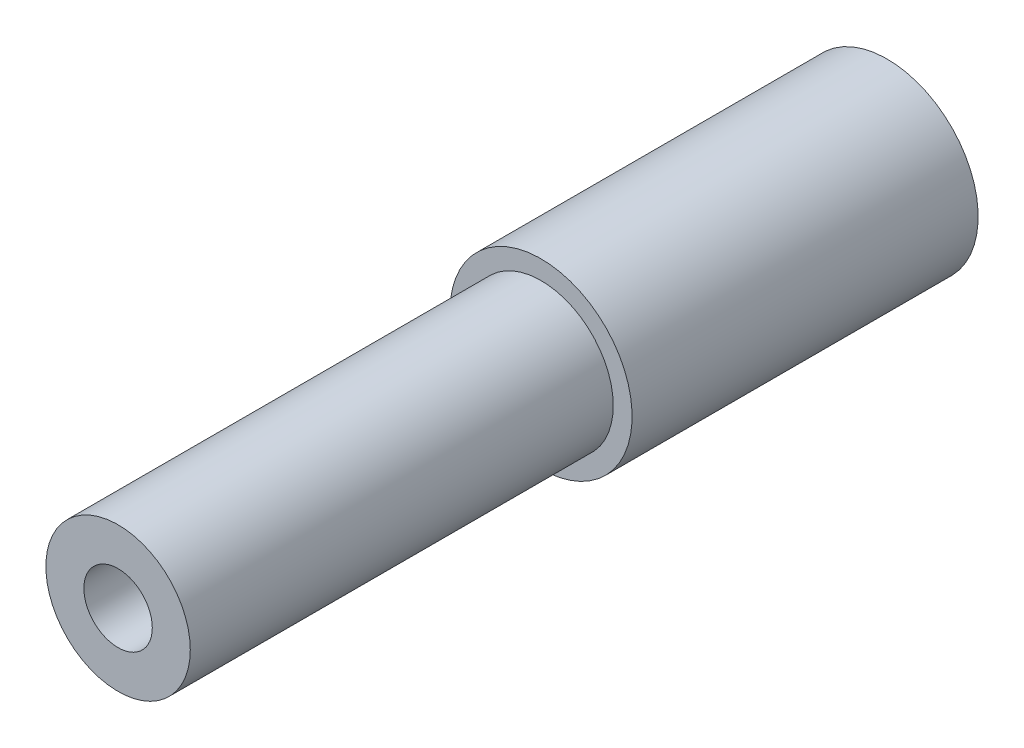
ISO-10303-21;
HEADER;
FILE_DESCRIPTION(('STEP AP214'),'2;1');
FILE_NAME('part.step','',(''),(''),'','','');
FILE_SCHEMA(('AUTOMOTIVE_DESIGN { 1 0 10303 214 1 1 1 1 }'));
ENDSEC;
DATA;
#1=APPLICATION_CONTEXT('core data for automotive mechanical design processes');
#2=APPLICATION_PROTOCOL_DEFINITION('international standard','automotive_design',2000,#1);
#3=PRODUCT_CONTEXT('',#1,'mechanical');
#4=PRODUCT('Part','Part','',(#3));
#5=PRODUCT_RELATED_PRODUCT_CATEGORY('part','',(#4));
#6=PRODUCT_DEFINITION_FORMATION('','',#4);
#7=PRODUCT_DEFINITION_CONTEXT('part definition',#1,'design');
#8=PRODUCT_DEFINITION('design','',#6,#7);
#9=PRODUCT_DEFINITION_SHAPE('','',#8);
#10=(LENGTH_UNIT() NAMED_UNIT(*) SI_UNIT(.MILLI.,.METRE.));
#11=(NAMED_UNIT(*) PLANE_ANGLE_UNIT() SI_UNIT($,.RADIAN.));
#12=(NAMED_UNIT(*) SI_UNIT($,.STERADIAN.) SOLID_ANGLE_UNIT());
#13=UNCERTAINTY_MEASURE_WITH_UNIT(LENGTH_MEASURE(1.E-05),#10,'distance_accuracy_value','');
#14=(GEOMETRIC_REPRESENTATION_CONTEXT(3) GLOBAL_UNCERTAINTY_ASSIGNED_CONTEXT((#13)) GLOBAL_UNIT_ASSIGNED_CONTEXT((#10,
#11,#12)) REPRESENTATION_CONTEXT('',''));
#15=CARTESIAN_POINT('',(0.,0.,0.));
#16=DIRECTION('',(0.,0.,1.));
#17=DIRECTION('',(1.,0.,0.));
#18=AXIS2_PLACEMENT_3D('',#15,#16,#17);
#19=CARTESIAN_POINT('',(0.,0.,-25.4));
#20=DIRECTION('',(0.,0.,0.999999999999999));
#21=DIRECTION('',(1.,0.,0.));
#22=AXIS2_PLACEMENT_3D('',#19,#20,#21);
#23=CYLINDRICAL_SURFACE('',#22,2.38506);
#24=CARTESIAN_POINT('',(0.,0.,0.));
#25=DIRECTION('',(0.,0.,0.999999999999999));
#26=DIRECTION('',(1.,0.,0.));
#27=AXIS2_PLACEMENT_3D('',#24,#25,#26);
#28=CIRCLE('',#27,2.38506);
#29=CARTESIAN_POINT('',(2.38505999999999,0.,0.));
#30=VERTEX_POINT('',#29);
#31=EDGE_CURVE('E11',#30,#30,#28,.T.);
#32=CARTESIAN_POINT('',(0.,0.,-13.97));
#33=DIRECTION('',(0.,0.,-0.999999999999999));
#34=DIRECTION('',(-1.,0.,0.));
#35=AXIS2_PLACEMENT_3D('',#32,#33,#34);
#36=CIRCLE('',#35,2.38506);
#37=CARTESIAN_POINT('',(2.38505999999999,0.,-13.97));
#38=VERTEX_POINT('',#37);
#39=EDGE_CURVE('E46',#38,#38,#36,.F.);
#40=CARTESIAN_POINT('',(2.38505999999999,0.,0.));
#41=CARTESIAN_POINT('',(2.38505999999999,0.,-0.145520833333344));
#42=CARTESIAN_POINT('',(2.38505999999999,0.,-0.291041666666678));
#43=CARTESIAN_POINT('',(2.38505999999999,0.,-0.582083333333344));
#44=CARTESIAN_POINT('',(2.38505999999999,0.,-0.727604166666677));
#45=CARTESIAN_POINT('',(2.38505999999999,0.,-1.01864583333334));
#46=CARTESIAN_POINT('',(2.38505999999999,0.,-1.16416666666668));
#47=CARTESIAN_POINT('',(2.38505999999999,0.,-1.45520833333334));
#48=CARTESIAN_POINT('',(2.38505999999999,0.,-1.60072916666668));
#49=CARTESIAN_POINT('',(2.38505999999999,0.,-1.89177083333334));
#50=CARTESIAN_POINT('',(2.38505999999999,0.,-2.03729166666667));
#51=CARTESIAN_POINT('',(2.38505999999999,0.,-2.32833333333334));
#52=CARTESIAN_POINT('',(2.38505999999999,0.,-2.47385416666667));
#53=CARTESIAN_POINT('',(2.38505999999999,0.,-2.76489583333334));
#54=CARTESIAN_POINT('',(2.38505999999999,0.,-2.91041666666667));
#55=CARTESIAN_POINT('',(2.38505999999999,0.,-3.20145833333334));
#56=CARTESIAN_POINT('',(2.38505999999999,0.,-3.34697916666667));
#57=CARTESIAN_POINT('',(2.38505999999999,0.,-3.63802083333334));
#58=CARTESIAN_POINT('',(2.38505999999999,0.,-3.78354166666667));
#59=CARTESIAN_POINT('',(2.38505999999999,0.,-4.07458333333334));
#60=CARTESIAN_POINT('',(2.38505999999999,0.,-4.22010416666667));
#61=CARTESIAN_POINT('',(2.38505999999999,0.,-4.51114583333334));
#62=CARTESIAN_POINT('',(2.38505999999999,0.,-4.65666666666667));
#63=CARTESIAN_POINT('',(2.38505999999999,0.,-4.94770833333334));
#64=CARTESIAN_POINT('',(2.38505999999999,0.,-5.09322916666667));
#65=CARTESIAN_POINT('',(2.38505999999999,0.,-5.38427083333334));
#66=CARTESIAN_POINT('',(2.38505999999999,0.,-5.52979166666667));
#67=CARTESIAN_POINT('',(2.38505999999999,0.,-5.82083333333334));
#68=CARTESIAN_POINT('',(2.38505999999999,0.,-5.96635416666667));
#69=CARTESIAN_POINT('',(2.38505999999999,0.,-6.25739583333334));
#70=CARTESIAN_POINT('',(2.38505999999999,0.,-6.40291666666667));
#71=CARTESIAN_POINT('',(2.38505999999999,0.,-6.69395833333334));
#72=CARTESIAN_POINT('',(2.38505999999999,0.,-6.83947916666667));
#73=CARTESIAN_POINT('',(2.38505999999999,0.,-7.13052083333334));
#74=CARTESIAN_POINT('',(2.38505999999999,0.,-7.27604166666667));
#75=CARTESIAN_POINT('',(2.38505999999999,0.,-7.56708333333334));
#76=CARTESIAN_POINT('',(2.38505999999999,0.,-7.71260416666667));
#77=CARTESIAN_POINT('',(2.38505999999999,0.,-8.00364583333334));
#78=CARTESIAN_POINT('',(2.38505999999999,0.,-8.14916666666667));
#79=CARTESIAN_POINT('',(2.38505999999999,0.,-8.44020833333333));
#80=CARTESIAN_POINT('',(2.38505999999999,0.,-8.58572916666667));
#81=CARTESIAN_POINT('',(2.38505999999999,0.,-8.87677083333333));
#82=CARTESIAN_POINT('',(2.38505999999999,0.,-9.02229166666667));
#83=CARTESIAN_POINT('',(2.38505999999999,0.,-9.31333333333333));
#84=CARTESIAN_POINT('',(2.38505999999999,0.,-9.45885416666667));
#85=CARTESIAN_POINT('',(2.38505999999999,0.,-9.74989583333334));
#86=CARTESIAN_POINT('',(2.38505999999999,0.,-9.89541666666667));
#87=CARTESIAN_POINT('',(2.38505999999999,0.,-10.1864583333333));
#88=CARTESIAN_POINT('',(2.38505999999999,0.,-10.3319791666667));
#89=CARTESIAN_POINT('',(2.38505999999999,0.,-10.6230208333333));
#90=CARTESIAN_POINT('',(2.38505999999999,0.,-10.7685416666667));
#91=CARTESIAN_POINT('',(2.38505999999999,0.,-11.0595833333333));
#92=CARTESIAN_POINT('',(2.38505999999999,0.,-11.2051041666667));
#93=CARTESIAN_POINT('',(2.38505999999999,0.,-11.4961458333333));
#94=CARTESIAN_POINT('',(2.38505999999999,0.,-11.6416666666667));
#95=CARTESIAN_POINT('',(2.38505999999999,0.,-11.9327083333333));
#96=CARTESIAN_POINT('',(2.38505999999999,0.,-12.0782291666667));
#97=CARTESIAN_POINT('',(2.38505999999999,0.,-12.3692708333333));
#98=CARTESIAN_POINT('',(2.38505999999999,0.,-12.5147916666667));
#99=CARTESIAN_POINT('',(2.38505999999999,0.,-12.8058333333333));
#100=CARTESIAN_POINT('',(2.38505999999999,0.,-12.9513541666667));
#101=CARTESIAN_POINT('',(2.38505999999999,0.,-13.2423958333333));
#102=CARTESIAN_POINT('',(2.38505999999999,0.,-13.3879166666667));
#103=CARTESIAN_POINT('',(2.38505999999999,0.,-13.6789583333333));
#104=CARTESIAN_POINT('',(2.38505999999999,0.,-13.8244791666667));
#105=CARTESIAN_POINT('',(2.38505999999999,0.,-13.97));
#106=B_SPLINE_CURVE_WITH_KNOTS('',3,(#40,#41,#42,#43,#44,#45,#46,#47,#48,#49,#50,#51,#52,#53,
#54,#55,#56,#57,#58,#59,#60,#61,#62,#63,#64,#65,#66,#67,#68,#69,#70,#71,#72,#73,#74,#75,#76,#77,
#78,#79,#80,#81,#82,#83,#84,#85,#86,#87,#88,#89,#90,#91,#92,#93,#94,#95,#96,#97,#98,#99,#100,
#101,#102,#103,#104,#105),.UNSPECIFIED.,.F.,.F.,(4,2,2,2,2,2,2,2,2,2,2,2,2,2,2,2,2,2,2,2,2,2,2,
2,2,2,2,2,2,2,2,2,4),(0.,0.436562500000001,0.873124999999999,1.3096875,1.74625,2.1828125,
2.619375,3.05593749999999,3.4925,3.92906249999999,4.36562499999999,4.8021875,5.23875,
5.67531249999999,6.111875,6.54843749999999,6.98499999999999,7.42156249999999,7.85812499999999,
8.29468749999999,8.73124999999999,9.16781249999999,9.60437499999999,10.0409375,10.4775,
10.9140625,11.350625,11.7871875,12.22375,12.6603125,13.096875,13.5334375,13.97),.UNSPECIFIED.);
#107=EDGE_CURVE('BSEAM43',#30,#38,#106,.T.);
#108=ORIENTED_EDGE('',*,*,#31,.F.);
#109=ORIENTED_EDGE('',*,*,#39,.T.);
#110=ORIENTED_EDGE('',*,*,#107,.T.);
#111=ORIENTED_EDGE('',*,*,#107,.F.);
#112=EDGE_LOOP('',(#108,#110,#109,#111));
#113=FACE_BOUND('',#112,.T.);
#114=ADVANCED_FACE('F43',(#113),#23,.T.);
#115=CARTESIAN_POINT('',(0.,0.,0.));
#116=DIRECTION('',(0.,0.,0.999999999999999));
#117=DIRECTION('',(1.,0.,0.));
#118=AXIS2_PLACEMENT_3D('',#115,#116,#117);
#119=PLANE('',#118);
#120=CARTESIAN_POINT('',(0.,0.,0.));
#121=DIRECTION('',(0.,0.,0.999999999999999));
#122=DIRECTION('',(1.,0.,0.));
#123=AXIS2_PLACEMENT_3D('',#120,#121,#122);
#124=CIRCLE('',#123,1.13029999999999);
#125=CARTESIAN_POINT('',(1.13029999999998,0.,0.));
#126=VERTEX_POINT('',#125);
#127=EDGE_CURVE('E66',#126,#126,#124,.T.);
#128=ORIENTED_EDGE('',*,*,#127,.F.);
#129=EDGE_LOOP('',(#128));
#130=FACE_BOUND('',#129,.T.);
#131=ORIENTED_EDGE('',*,*,#31,.T.);
#132=EDGE_LOOP('',(#131));
#133=FACE_BOUND('',#132,.T.);
#134=ADVANCED_FACE('F96',(#130,#133),#119,.T.);
#135=CARTESIAN_POINT('',(0.,0.,-13.97));
#136=DIRECTION('',(0.,0.,-0.999999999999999));
#137=DIRECTION('',(-1.,0.,0.));
#138=AXIS2_PLACEMENT_3D('',#135,#136,#137);
#139=CYLINDRICAL_SURFACE('',#138,3.00736);
#140=CARTESIAN_POINT('',(0.,0.,-13.97));
#141=DIRECTION('',(0.,0.,-0.999999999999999));
#142=DIRECTION('',(-1.,0.,0.));
#143=AXIS2_PLACEMENT_3D('',#140,#141,#142);
#144=CIRCLE('',#143,3.00736);
#145=CARTESIAN_POINT('',(-3.00736000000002,0.,-13.97));
#146=VERTEX_POINT('',#145);
#147=EDGE_CURVE('E71',#146,#146,#144,.T.);
#148=CARTESIAN_POINT('',(0.,0.,-25.4));
#149=DIRECTION('',(0.,0.,-0.999999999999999));
#150=DIRECTION('',(-1.,0.,0.));
#151=AXIS2_PLACEMENT_3D('',#148,#149,#150);
#152=CIRCLE('',#151,3.00736);
#153=CARTESIAN_POINT('',(-3.00736000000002,0.,-25.4));
#154=VERTEX_POINT('',#153);
#155=EDGE_CURVE('E65',#154,#154,#152,.T.);
#156=CARTESIAN_POINT('',(-3.00736000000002,0.,-13.97));
#157=CARTESIAN_POINT('',(-3.00736000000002,0.,-14.0890625));
#158=CARTESIAN_POINT('',(-3.00736000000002,0.,-14.208125));
#159=CARTESIAN_POINT('',(-3.00736000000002,0.,-14.44625));
#160=CARTESIAN_POINT('',(-3.00736000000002,0.,-14.5653125));
#161=CARTESIAN_POINT('',(-3.00736000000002,0.,-14.8034375));
#162=CARTESIAN_POINT('',(-3.00736000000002,0.,-14.9225));
#163=CARTESIAN_POINT('',(-3.00736000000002,0.,-15.160625));
#164=CARTESIAN_POINT('',(-3.00736000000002,0.,-15.2796875));
#165=CARTESIAN_POINT('',(-3.00736000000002,0.,-15.5178125));
#166=CARTESIAN_POINT('',(-3.00736000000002,0.,-15.636875));
#167=CARTESIAN_POINT('',(-3.00736000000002,0.,-15.875));
#168=CARTESIAN_POINT('',(-3.00736000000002,0.,-15.9940625));
#169=CARTESIAN_POINT('',(-3.00736000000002,0.,-16.2321875));
#170=CARTESIAN_POINT('',(-3.00736000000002,0.,-16.35125));
#171=CARTESIAN_POINT('',(-3.00736000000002,0.,-16.589375));
#172=CARTESIAN_POINT('',(-3.00736000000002,0.,-16.7084375));
#173=CARTESIAN_POINT('',(-3.00736000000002,0.,-16.9465625));
#174=CARTESIAN_POINT('',(-3.00736000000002,0.,-17.065625));
#175=CARTESIAN_POINT('',(-3.00736000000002,0.,-17.30375));
#176=CARTESIAN_POINT('',(-3.00736000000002,0.,-17.4228125));
#177=CARTESIAN_POINT('',(-3.00736000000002,0.,-17.6609375));
#178=CARTESIAN_POINT('',(-3.00736000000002,0.,-17.78));
#179=CARTESIAN_POINT('',(-3.00736000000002,0.,-18.018125));
#180=CARTESIAN_POINT('',(-3.00736000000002,0.,-18.1371875));
#181=CARTESIAN_POINT('',(-3.00736000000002,0.,-18.3753125));
#182=CARTESIAN_POINT('',(-3.00736000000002,0.,-18.494375));
#183=CARTESIAN_POINT('',(-3.00736000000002,0.,-18.7325));
#184=CARTESIAN_POINT('',(-3.00736000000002,0.,-18.8515625));
#185=CARTESIAN_POINT('',(-3.00736000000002,0.,-19.0896875));
#186=CARTESIAN_POINT('',(-3.00736000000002,0.,-19.20875));
#187=CARTESIAN_POINT('',(-3.00736000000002,0.,-19.446875));
#188=CARTESIAN_POINT('',(-3.00736000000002,0.,-19.5659375));
#189=CARTESIAN_POINT('',(-3.00736000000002,0.,-19.8040625));
#190=CARTESIAN_POINT('',(-3.00736000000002,0.,-19.923125));
#191=CARTESIAN_POINT('',(-3.00736000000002,0.,-20.16125));
#192=CARTESIAN_POINT('',(-3.00736000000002,0.,-20.2803125));
#193=CARTESIAN_POINT('',(-3.00736000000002,0.,-20.5184375));
#194=CARTESIAN_POINT('',(-3.00736000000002,0.,-20.6375));
#195=CARTESIAN_POINT('',(-3.00736000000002,0.,-20.875625));
#196=CARTESIAN_POINT('',(-3.00736000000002,0.,-20.9946875));
#197=CARTESIAN_POINT('',(-3.00736000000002,0.,-21.2328125));
#198=CARTESIAN_POINT('',(-3.00736000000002,0.,-21.351875));
#199=CARTESIAN_POINT('',(-3.00736000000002,0.,-21.59));
#200=CARTESIAN_POINT('',(-3.00736000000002,0.,-21.7090625));
#201=CARTESIAN_POINT('',(-3.00736000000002,0.,-21.9471875));
#202=CARTESIAN_POINT('',(-3.00736000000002,0.,-22.06625));
#203=CARTESIAN_POINT('',(-3.00736000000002,0.,-22.304375));
#204=CARTESIAN_POINT('',(-3.00736000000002,0.,-22.4234375));
#205=CARTESIAN_POINT('',(-3.00736000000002,0.,-22.6615625));
#206=CARTESIAN_POINT('',(-3.00736000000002,0.,-22.780625));
#207=CARTESIAN_POINT('',(-3.00736000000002,0.,-23.01875));
#208=CARTESIAN_POINT('',(-3.00736000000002,0.,-23.1378125));
#209=CARTESIAN_POINT('',(-3.00736000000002,0.,-23.3759375));
#210=CARTESIAN_POINT('',(-3.00736000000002,0.,-23.495));
#211=CARTESIAN_POINT('',(-3.00736000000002,0.,-23.733125));
#212=CARTESIAN_POINT('',(-3.00736000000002,0.,-23.8521875));
#213=CARTESIAN_POINT('',(-3.00736000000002,0.,-24.0903125));
#214=CARTESIAN_POINT('',(-3.00736000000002,0.,-24.209375));
#215=CARTESIAN_POINT('',(-3.00736000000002,0.,-24.4475));
#216=CARTESIAN_POINT('',(-3.00736000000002,0.,-24.5665625));
#217=CARTESIAN_POINT('',(-3.00736000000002,0.,-24.8046875));
#218=CARTESIAN_POINT('',(-3.00736000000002,0.,-24.92375));
#219=CARTESIAN_POINT('',(-3.00736000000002,0.,-25.161875));
#220=CARTESIAN_POINT('',(-3.00736000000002,0.,-25.2809375));
#221=CARTESIAN_POINT('',(-3.00736000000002,0.,-25.4));
#222=B_SPLINE_CURVE_WITH_KNOTS('',3,(#156,#157,#158,#159,#160,#161,#162,#163,#164,#165,#166,
#167,#168,#169,#170,#171,#172,#173,#174,#175,#176,#177,#178,#179,#180,#181,#182,#183,#184,#185,
#186,#187,#188,#189,#190,#191,#192,#193,#194,#195,#196,#197,#198,#199,#200,#201,#202,#203,#204,
#205,#206,#207,#208,#209,#210,#211,#212,#213,#214,#215,#216,#217,#218,#219,#220,#221),
.UNSPECIFIED.,.F.,.F.,(4,2,2,2,2,2,2,2,2,2,2,2,2,2,2,2,2,2,2,2,2,2,2,2,2,2,2,2,2,2,2,2,4),(0.,
0.357187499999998,0.714374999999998,1.0715625,1.42875,1.7859375,2.14312499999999,
2.50031249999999,2.85749999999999,3.21468749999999,3.57187499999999,3.92906249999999,
4.28624999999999,4.64343749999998,5.00062499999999,5.35781249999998,5.71499999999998,
6.07218749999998,6.42937499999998,6.78656249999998,7.14374999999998,7.50093749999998,
7.85812499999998,8.21531249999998,8.57249999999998,8.92968749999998,9.28687499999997,
9.64406249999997,10.00125,10.3584375,10.715625,11.0728125,11.43),.UNSPECIFIED.);
#223=EDGE_CURVE('BSEAM88',#146,#154,#222,.T.);
#224=ORIENTED_EDGE('',*,*,#147,.T.);
#225=ORIENTED_EDGE('',*,*,#155,.F.);
#226=ORIENTED_EDGE('',*,*,#223,.T.);
#227=ORIENTED_EDGE('',*,*,#223,.F.);
#228=EDGE_LOOP('',(#224,#226,#225,#227));
#229=FACE_BOUND('',#228,.T.);
#230=ADVANCED_FACE('F88',(#229),#139,.T.);
#231=CARTESIAN_POINT('',(0.,0.,-13.97));
#232=DIRECTION('',(0.,0.,-0.999999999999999));
#233=DIRECTION('',(-1.,0.,0.));
#234=AXIS2_PLACEMENT_3D('',#231,#232,#233);
#235=PLANE('',#234);
#236=ORIENTED_EDGE('',*,*,#39,.F.);
#237=EDGE_LOOP('',(#236));
#238=FACE_BOUND('',#237,.T.);
#239=ORIENTED_EDGE('',*,*,#147,.F.);
#240=EDGE_LOOP('',(#239));
#241=FACE_BOUND('',#240,.T.);
#242=ADVANCED_FACE('F85',(#238,#241),#235,.F.);
#243=CARTESIAN_POINT('',(0.,0.,-25.4));
#244=DIRECTION('',(0.,0.,0.999999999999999));
#245=DIRECTION('',(1.,0.,0.));
#246=AXIS2_PLACEMENT_3D('',#243,#244,#245);
#247=PLANE('',#246);
#248=ORIENTED_EDGE('',*,*,#155,.T.);
#249=EDGE_LOOP('',(#248));
#250=FACE_BOUND('',#249,.T.);
#251=ADVANCED_FACE('F58',(#250),#247,.F.);
#252=CARTESIAN_POINT('',(0.,0.,-8.8646));
#253=DIRECTION('',(0.,0.,0.999999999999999));
#254=DIRECTION('',(1.,0.,0.));
#255=AXIS2_PLACEMENT_3D('',#252,#253,#254);
#256=CONICAL_SURFACE('',#255,1.13029999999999,1.02974425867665);
#257=CARTESIAN_POINT('',(0.,0.,-9.54375275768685));
#258=VERTEX_POINT('',#257);
#259=VERTEX_LOOP('',#258);
#260=FACE_BOUND('',#259,.T.);
#261=CARTESIAN_POINT('',(0.,0.,-8.8646));
#262=DIRECTION('',(0.,0.,0.999999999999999));
#263=DIRECTION('',(1.,0.,0.));
#264=AXIS2_PLACEMENT_3D('',#261,#262,#263);
#265=CIRCLE('',#264,1.13029999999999);
#266=CARTESIAN_POINT('',(1.13029999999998,0.,-8.8646));
#267=VERTEX_POINT('',#266);
#268=EDGE_CURVE('E62',#267,#267,#265,.T.);
#269=ORIENTED_EDGE('',*,*,#268,.T.);
#270=EDGE_LOOP('',(#269));
#271=FACE_BOUND('',#270,.T.);
#272=ADVANCED_FACE('F54',(#260,#271),#256,.F.);
#273=CARTESIAN_POINT('',(0.,0.,0.));
#274=DIRECTION('',(0.,0.,0.999999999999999));
#275=DIRECTION('',(1.,0.,0.));
#276=AXIS2_PLACEMENT_3D('',#273,#274,#275);
#277=CYLINDRICAL_SURFACE('',#276,1.13029999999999);
#278=CARTESIAN_POINT('',(1.13029999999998,0.,-8.8646));
#279=CARTESIAN_POINT('',(1.13029999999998,0.,-8.77226041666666));
#280=CARTESIAN_POINT('',(1.13029999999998,0.,-8.67992083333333));
#281=CARTESIAN_POINT('',(1.13029999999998,0.,-8.49524166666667));
#282=CARTESIAN_POINT('',(1.13029999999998,0.,-8.40290208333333));
#283=CARTESIAN_POINT('',(1.13029999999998,0.,-8.21822291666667));
#284=CARTESIAN_POINT('',(1.13029999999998,0.,-8.12588333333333));
#285=CARTESIAN_POINT('',(1.13029999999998,0.,-7.94120416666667));
#286=CARTESIAN_POINT('',(1.13029999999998,0.,-7.84886458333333));
#287=CARTESIAN_POINT('',(1.13029999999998,0.,-7.66418541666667));
#288=CARTESIAN_POINT('',(1.13029999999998,0.,-7.57184583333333));
#289=CARTESIAN_POINT('',(1.13029999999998,0.,-7.38716666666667));
#290=CARTESIAN_POINT('',(1.13029999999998,0.,-7.29482708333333));
#291=CARTESIAN_POINT('',(1.13029999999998,0.,-7.11014791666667));
#292=CARTESIAN_POINT('',(1.13029999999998,0.,-7.01780833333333));
#293=CARTESIAN_POINT('',(1.13029999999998,0.,-6.83312916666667));
#294=CARTESIAN_POINT('',(1.13029999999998,0.,-6.74078958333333));
#295=CARTESIAN_POINT('',(1.13029999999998,0.,-6.55611041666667));
#296=CARTESIAN_POINT('',(1.13029999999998,0.,-6.46377083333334));
#297=CARTESIAN_POINT('',(1.13029999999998,0.,-6.27909166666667));
#298=CARTESIAN_POINT('',(1.13029999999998,0.,-6.18675208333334));
#299=CARTESIAN_POINT('',(1.13029999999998,0.,-6.00207291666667));
#300=CARTESIAN_POINT('',(1.13029999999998,0.,-5.90973333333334));
#301=CARTESIAN_POINT('',(1.13029999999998,0.,-5.72505416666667));
#302=CARTESIAN_POINT('',(1.13029999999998,0.,-5.63271458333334));
#303=CARTESIAN_POINT('',(1.13029999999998,0.,-5.44803541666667));
#304=CARTESIAN_POINT('',(1.13029999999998,0.,-5.35569583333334));
#305=CARTESIAN_POINT('',(1.13029999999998,0.,-5.17101666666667));
#306=CARTESIAN_POINT('',(1.13029999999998,0.,-5.07867708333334));
#307=CARTESIAN_POINT('',(1.13029999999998,0.,-4.89399791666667));
#308=CARTESIAN_POINT('',(1.13029999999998,0.,-4.80165833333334));
#309=CARTESIAN_POINT('',(1.13029999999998,0.,-4.61697916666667));
#310=CARTESIAN_POINT('',(1.13029999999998,0.,-4.52463958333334));
#311=CARTESIAN_POINT('',(1.13029999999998,0.,-4.33996041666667));
#312=CARTESIAN_POINT('',(1.13029999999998,0.,-4.24762083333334));
#313=CARTESIAN_POINT('',(1.13029999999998,0.,-4.06294166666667));
#314=CARTESIAN_POINT('',(1.13029999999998,0.,-3.97060208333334));
#315=CARTESIAN_POINT('',(1.13029999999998,0.,-3.78592291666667));
#316=CARTESIAN_POINT('',(1.13029999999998,0.,-3.69358333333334));
#317=CARTESIAN_POINT('',(1.13029999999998,0.,-3.50890416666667));
#318=CARTESIAN_POINT('',(1.13029999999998,0.,-3.41656458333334));
#319=CARTESIAN_POINT('',(1.13029999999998,0.,-3.23188541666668));
#320=CARTESIAN_POINT('',(1.13029999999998,0.,-3.13954583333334));
#321=CARTESIAN_POINT('',(1.13029999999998,0.,-2.95486666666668));
#322=CARTESIAN_POINT('',(1.13029999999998,0.,-2.86252708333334));
#323=CARTESIAN_POINT('',(1.13029999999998,0.,-2.67784791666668));
#324=CARTESIAN_POINT('',(1.13029999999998,0.,-2.58550833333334));
#325=CARTESIAN_POINT('',(1.13029999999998,0.,-2.40082916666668));
#326=CARTESIAN_POINT('',(1.13029999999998,0.,-2.30848958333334));
#327=CARTESIAN_POINT('',(1.13029999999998,0.,-2.12381041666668));
#328=CARTESIAN_POINT('',(1.13029999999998,0.,-2.03147083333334));
#329=CARTESIAN_POINT('',(1.13029999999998,0.,-1.84679166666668));
#330=CARTESIAN_POINT('',(1.13029999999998,0.,-1.75445208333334));
#331=CARTESIAN_POINT('',(1.13029999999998,0.,-1.56977291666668));
#332=CARTESIAN_POINT('',(1.13029999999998,0.,-1.47743333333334));
#333=CARTESIAN_POINT('',(1.13029999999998,0.,-1.29275416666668));
#334=CARTESIAN_POINT('',(1.13029999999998,0.,-1.20041458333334));
#335=CARTESIAN_POINT('',(1.13029999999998,0.,-1.01573541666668));
#336=CARTESIAN_POINT('',(1.13029999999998,0.,-0.923395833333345));
#337=CARTESIAN_POINT('',(1.13029999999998,0.,-0.738716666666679));
#338=CARTESIAN_POINT('',(1.13029999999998,0.,-0.646377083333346));
#339=CARTESIAN_POINT('',(1.13029999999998,0.,-0.46169791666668));
#340=CARTESIAN_POINT('',(1.13029999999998,0.,-0.369358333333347));
#341=CARTESIAN_POINT('',(1.13029999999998,0.,-0.18467916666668));
#342=CARTESIAN_POINT('',(1.13029999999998,0.,-0.0923395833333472));
#343=CARTESIAN_POINT('',(1.13029999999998,0.,0.));
#344=B_SPLINE_CURVE_WITH_KNOTS('',3,(#278,#279,#280,#281,#282,#283,#284,#285,#286,#287,#288,
#289,#290,#291,#292,#293,#294,#295,#296,#297,#298,#299,#300,#301,#302,#303,#304,#305,#306,#307,
#308,#309,#310,#311,#312,#313,#314,#315,#316,#317,#318,#319,#320,#321,#322,#323,#324,#325,#326,
#327,#328,#329,#330,#331,#332,#333,#334,#335,#336,#337,#338,#339,#340,#341,#342,#343),
.UNSPECIFIED.,.F.,.F.,(4,2,2,2,2,2,2,2,2,2,2,2,2,2,2,2,2,2,2,2,2,2,2,2,2,2,2,2,2,2,2,2,4),(0.,
0.27701875,0.5540375,0.831056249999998,1.108075,1.38509375,1.6621125,1.93913125,2.21615,
2.49316875,2.7701875,3.04720625,3.32422499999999,3.60124374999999,3.87826249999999,
4.15528124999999,4.43229999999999,4.70931874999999,4.98633749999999,5.26335624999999,
5.54037499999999,5.81739374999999,6.09441249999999,6.37143124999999,6.64844999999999,
6.92546874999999,7.20248749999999,7.47950624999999,7.75652499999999,8.03354374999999,
8.31056249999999,8.58758124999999,8.86459999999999),.UNSPECIFIED.);
#345=EDGE_CURVE('BSEAM57',#267,#126,#344,.T.);
#346=ORIENTED_EDGE('',*,*,#268,.F.);
#347=ORIENTED_EDGE('',*,*,#127,.T.);
#348=ORIENTED_EDGE('',*,*,#345,.T.);
#349=ORIENTED_EDGE('',*,*,#345,.F.);
#350=EDGE_LOOP('',(#346,#348,#347,#349));
#351=FACE_BOUND('',#350,.T.);
#352=ADVANCED_FACE('F57',(#351),#277,.F.);
#353=CLOSED_SHELL('',(#114,#134,#230,#242,#251,#272,#352));
#354=MANIFOLD_SOLID_BREP('B2',#353);
#355=ADVANCED_BREP_SHAPE_REPRESENTATION('',(#18,#354),#14);
#356=SHAPE_DEFINITION_REPRESENTATION(#9,#355);
ENDSEC;
END-ISO-10303-21;
